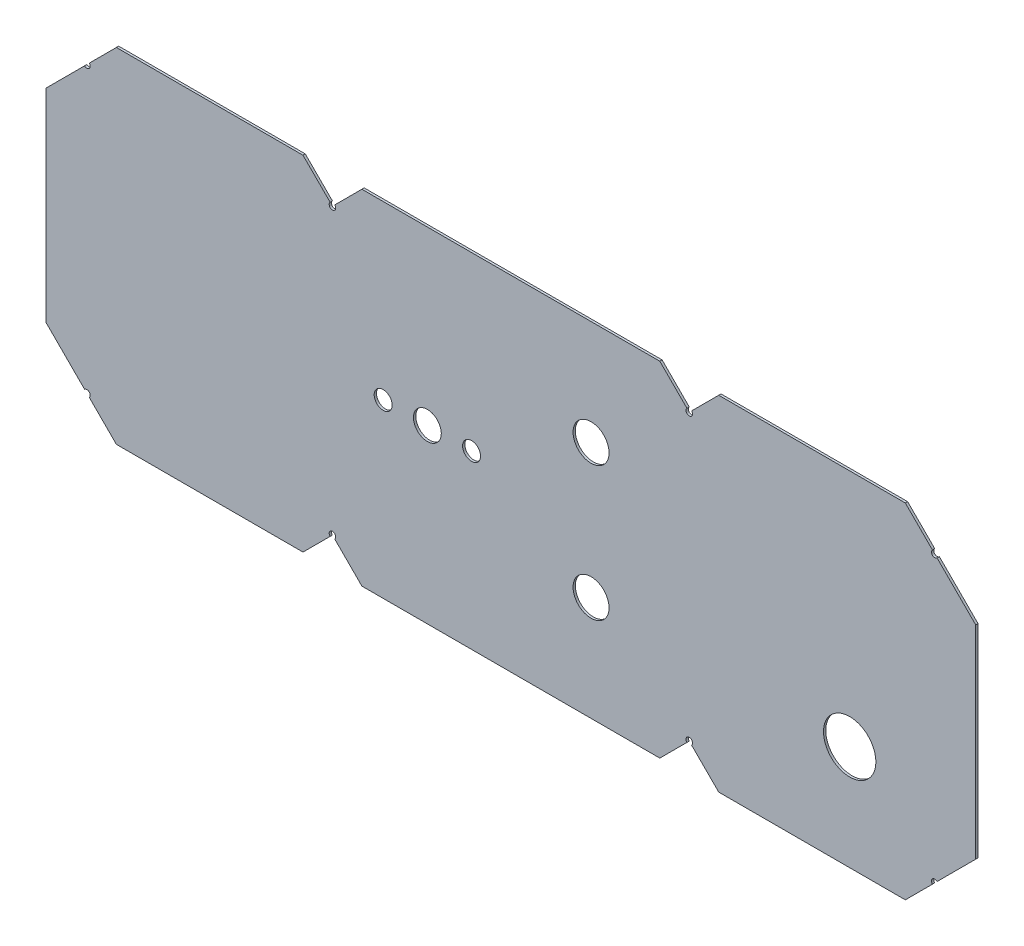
ISO-10303-21;
HEADER;
FILE_DESCRIPTION(('STEP AP214'),'2;1');
FILE_NAME('part.step','',(''),(''),'','','');
FILE_SCHEMA(('AUTOMOTIVE_DESIGN { 1 0 10303 214 1 1 1 1 }'));
ENDSEC;
DATA;
#1=APPLICATION_CONTEXT('core data for automotive mechanical design processes');
#2=APPLICATION_PROTOCOL_DEFINITION('international standard','automotive_design',2000,#1);
#3=PRODUCT_CONTEXT('',#1,'mechanical');
#4=PRODUCT('Part','Part','',(#3));
#5=PRODUCT_RELATED_PRODUCT_CATEGORY('part','',(#4));
#6=PRODUCT_DEFINITION_FORMATION('','',#4);
#7=PRODUCT_DEFINITION_CONTEXT('part definition',#1,'design');
#8=PRODUCT_DEFINITION('design','',#6,#7);
#9=PRODUCT_DEFINITION_SHAPE('','',#8);
#10=(LENGTH_UNIT() NAMED_UNIT(*) SI_UNIT(.MILLI.,.METRE.));
#11=(NAMED_UNIT(*) PLANE_ANGLE_UNIT() SI_UNIT($,.RADIAN.));
#12=(NAMED_UNIT(*) SI_UNIT($,.STERADIAN.) SOLID_ANGLE_UNIT());
#13=UNCERTAINTY_MEASURE_WITH_UNIT(LENGTH_MEASURE(1.E-05),#10,'distance_accuracy_value','');
#14=(GEOMETRIC_REPRESENTATION_CONTEXT(3) GLOBAL_UNCERTAINTY_ASSIGNED_CONTEXT((#13)) GLOBAL_UNIT_ASSIGNED_CONTEXT((#10,
#11,#12)) REPRESENTATION_CONTEXT('',''));
#15=CARTESIAN_POINT('',(0.,0.,0.));
#16=DIRECTION('',(0.,0.,1.));
#17=DIRECTION('',(1.,0.,0.));
#18=AXIS2_PLACEMENT_3D('',#15,#16,#17);
#19=CARTESIAN_POINT('',(86.4999999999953,9.00000000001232,0.7));
#20=DIRECTION('',(0.,0.,1.));
#21=DIRECTION('',(1.,0.,0.));
#22=AXIS2_PLACEMENT_3D('',#19,#20,#21);
#23=PLANE('',#22);
#24=CARTESIAN_POINT('',(129.,52.4999999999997,0.7));
#25=DIRECTION('',(0.,0.,1.));
#26=DIRECTION('',(1.,0.,0.));
#27=AXIS2_PLACEMENT_3D('',#24,#25,#26);
#28=CIRCLE('',#27,2.75000000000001);
#29=CARTESIAN_POINT('',(131.75,52.4999999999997,0.7));
#30=VERTEX_POINT('',#29);
#31=EDGE_CURVE('E543',#30,#30,#28,.T.);
#32=ORIENTED_EDGE('',*,*,#31,.F.);
#33=EDGE_LOOP('',(#32));
#34=FACE_BOUND('',#33,.T.);
#35=CARTESIAN_POINT('',(165.5,31.9999999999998,0.7));
#36=DIRECTION('',(0.,0.,1.));
#37=DIRECTION('',(1.,0.,0.));
#38=AXIS2_PLACEMENT_3D('',#35,#36,#37);
#39=CIRCLE('',#38,5.49999999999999);
#40=CARTESIAN_POINT('',(171.,31.9999999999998,0.7));
#41=VERTEX_POINT('',#40);
#42=EDGE_CURVE('E531',#41,#41,#39,.T.);
#43=ORIENTED_EDGE('',*,*,#42,.F.);
#44=EDGE_LOOP('',(#43));
#45=FACE_BOUND('',#44,.T.);
#46=CARTESIAN_POINT('',(244.5,32.,0.7));
#47=DIRECTION('',(0.,0.,1.));
#48=DIRECTION('',(1.,0.,0.));
#49=AXIS2_PLACEMENT_3D('',#46,#47,#48);
#50=CIRCLE('',#49,7.99999999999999);
#51=CARTESIAN_POINT('',(252.5,32.,0.7));
#52=VERTEX_POINT('',#51);
#53=EDGE_CURVE('E277',#52,#52,#50,.T.);
#54=ORIENTED_EDGE('',*,*,#53,.F.);
#55=EDGE_LOOP('',(#54));
#56=FACE_BOUND('',#55,.T.);
#57=DIRECTION('',(1.,0.,0.));
#58=VECTOR('',#57,1.);
#59=CARTESIAN_POINT('',(186.499999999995,1.31370660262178E-11,0.7));
#60=LINE('',#59,#58);
#61=CARTESIAN_POINT('',(95.4999999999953,1.31259217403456E-11,0.7));
#62=VERTEX_POINT('',#61);
#63=CARTESIAN_POINT('',(186.499999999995,1.31370660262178E-11,0.7));
#64=VERTEX_POINT('',#63);
#65=EDGE_CURVE('E351',#62,#64,#60,.T.);
#66=ORIENTED_EDGE('',*,*,#65,.T.);
#67=DIRECTION('',(0.707106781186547,0.707106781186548,0.));
#68=VECTOR('',#67,1.);
#69=CARTESIAN_POINT('',(194.439339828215,7.93933982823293,0.7));
#70=LINE('',#69,#68);
#71=CARTESIAN_POINT('',(194.792893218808,8.29289321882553,0.7));
#72=VERTEX_POINT('',#71);
#73=EDGE_CURVE('E162',#64,#72,#70,.T.);
#74=ORIENTED_EDGE('',*,*,#73,.T.);
#75=CARTESIAN_POINT('',(195.499999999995,9.00000000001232,0.7));
#76=DIRECTION('',(0.,0.,-1.));
#77=DIRECTION('',(1.,0.,0.));
#78=AXIS2_PLACEMENT_3D('',#75,#76,#77);
#79=CIRCLE('',#78,1.00000000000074);
#80=CARTESIAN_POINT('',(196.207106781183,8.29289321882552,0.7));
#81=VERTEX_POINT('',#80);
#82=EDGE_CURVE('E439',#72,#81,#79,.T.);
#83=ORIENTED_EDGE('',*,*,#82,.T.);
#84=DIRECTION('',(0.707106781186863,-0.707106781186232,0.));
#85=VECTOR('',#84,1.);
#86=CARTESIAN_POINT('',(196.560660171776,7.93933982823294,0.7));
#87=LINE('',#86,#85);
#88=CARTESIAN_POINT('',(204.499999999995,1.31392703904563E-11,0.7));
#89=VERTEX_POINT('',#88);
#90=EDGE_CURVE('E454',#81,#89,#87,.T.);
#91=ORIENTED_EDGE('',*,*,#90,.T.);
#92=DIRECTION('',(1.,0.,0.));
#93=VECTOR('',#92,1.);
#94=CARTESIAN_POINT('',(261.499999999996,1.31462508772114E-11,0.7));
#95=LINE('',#94,#93);
#96=CARTESIAN_POINT('',(261.499999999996,1.31462508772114E-11,0.7));
#97=VERTEX_POINT('',#96);
#98=EDGE_CURVE('E451',#89,#97,#95,.T.);
#99=ORIENTED_EDGE('',*,*,#98,.T.);
#100=DIRECTION('',(0.707106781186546,0.707106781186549,0.));
#101=VECTOR('',#100,1.);
#102=CARTESIAN_POINT('',(269.439339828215,7.93933982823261,0.7));
#103=LINE('',#102,#101);
#104=CARTESIAN_POINT('',(269.792893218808,8.29289321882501,0.7));
#105=VERTEX_POINT('',#104);
#106=EDGE_CURVE('E453',#97,#105,#103,.T.);
#107=ORIENTED_EDGE('',*,*,#106,.T.);
#108=CARTESIAN_POINT('',(270.499999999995,9.00000000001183,0.7));
#109=DIRECTION('',(0.,0.,-1.));
#110=DIRECTION('',(1.,0.,0.));
#111=AXIS2_PLACEMENT_3D('',#108,#109,#110);
#112=CIRCLE('',#111,1.00000000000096);
#113=CARTESIAN_POINT('',(271.207106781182,9.70710678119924,0.7));
#114=VERTEX_POINT('',#113);
#115=EDGE_CURVE('E456',#105,#114,#112,.T.);
#116=ORIENTED_EDGE('',*,*,#115,.T.);
#117=DIRECTION('',(0.707106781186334,0.707106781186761,0.));
#118=VECTOR('',#117,1.);
#119=CARTESIAN_POINT('',(271.560660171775,10.060660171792,0.7));
#120=LINE('',#119,#118);
#121=CARTESIAN_POINT('',(282.999999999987,21.5000000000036,0.7));
#122=VERTEX_POINT('',#121);
#123=EDGE_CURVE('E462',#114,#122,#120,.T.);
#124=ORIENTED_EDGE('',*,*,#123,.T.);
#125=DIRECTION('',(0.,1.,0.));
#126=VECTOR('',#125,1.);
#127=CARTESIAN_POINT('',(282.999999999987,83.5000000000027,0.7));
#128=LINE('',#127,#126);
#129=CARTESIAN_POINT('',(282.999999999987,83.5000000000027,0.7));
#130=VERTEX_POINT('',#129);
#131=EDGE_CURVE('E464',#122,#130,#128,.T.);
#132=ORIENTED_EDGE('',*,*,#131,.T.);
#133=DIRECTION('',(-0.707106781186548,0.707106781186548,0.));
#134=VECTOR('',#133,1.);
#135=CARTESIAN_POINT('',(281.99999999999,84.4999999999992,0.7));
#136=LINE('',#135,#134);
#137=CARTESIAN_POINT('',(271.207106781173,95.2928932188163,0.7));
#138=VERTEX_POINT('',#137);
#139=EDGE_CURVE('E466',#130,#138,#136,.T.);
#140=ORIENTED_EDGE('',*,*,#139,.T.);
#141=CARTESIAN_POINT('',(270.499999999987,96.0000000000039,0.7));
#142=DIRECTION('',(0.,0.,-1.));
#143=DIRECTION('',(1.,0.,0.));
#144=AXIS2_PLACEMENT_3D('',#141,#142,#143);
#145=CIRCLE('',#144,1.00000000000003);
#146=CARTESIAN_POINT('',(269.7928932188,96.7071067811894,0.7));
#147=VERTEX_POINT('',#146);
#148=EDGE_CURVE('E468',#138,#147,#145,.T.);
#149=ORIENTED_EDGE('',*,*,#148,.T.);
#150=DIRECTION('',(-0.707106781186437,0.707106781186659,0.));
#151=VECTOR('',#150,1.);
#152=CARTESIAN_POINT('',(269.439339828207,97.0606601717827,0.7));
#153=LINE('',#152,#151);
#154=CARTESIAN_POINT('',(261.499999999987,105.000000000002,0.7));
#155=VERTEX_POINT('',#154);
#156=EDGE_CURVE('E470',#147,#155,#153,.T.);
#157=ORIENTED_EDGE('',*,*,#156,.T.);
#158=DIRECTION('',(-1.,0.,0.));
#159=VECTOR('',#158,1.);
#160=CARTESIAN_POINT('',(204.499999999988,105.000000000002,0.7));
#161=LINE('',#160,#159);
#162=CARTESIAN_POINT('',(204.499999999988,105.000000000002,0.7));
#163=VERTEX_POINT('',#162);
#164=EDGE_CURVE('E472',#155,#163,#161,.T.);
#165=ORIENTED_EDGE('',*,*,#164,.T.);
#166=DIRECTION('',(-0.707106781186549,-0.707106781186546,0.));
#167=VECTOR('',#166,1.);
#168=CARTESIAN_POINT('',(196.560660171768,97.0606601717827,0.7));
#169=LINE('',#168,#167);
#170=CARTESIAN_POINT('',(196.207106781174,96.7071067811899,0.7));
#171=VERTEX_POINT('',#170);
#172=EDGE_CURVE('E474',#163,#171,#169,.T.);
#173=ORIENTED_EDGE('',*,*,#172,.T.);
#174=CARTESIAN_POINT('',(195.499999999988,96.0000000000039,0.7));
#175=DIRECTION('',(0.,0.,-1.));
#176=DIRECTION('',(1.,0.,0.));
#177=AXIS2_PLACEMENT_3D('',#174,#175,#176);
#178=CIRCLE('',#177,0.999999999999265);
#179=CARTESIAN_POINT('',(194.7928932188,96.7071067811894,0.7));
#180=VERTEX_POINT('',#179);
#181=EDGE_CURVE('E476',#171,#180,#178,.T.);
#182=ORIENTED_EDGE('',*,*,#181,.T.);
#183=DIRECTION('',(-0.70710678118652,0.707106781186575,0.));
#184=VECTOR('',#183,1.);
#185=CARTESIAN_POINT('',(194.439339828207,97.0606601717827,0.7));
#186=LINE('',#185,#184);
#187=CARTESIAN_POINT('',(186.499999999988,105.000000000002,0.7));
#188=VERTEX_POINT('',#187);
#189=EDGE_CURVE('E478',#180,#188,#186,.T.);
#190=ORIENTED_EDGE('',*,*,#189,.T.);
#191=DIRECTION('',(-1.,0.,0.));
#192=VECTOR('',#191,1.);
#193=CARTESIAN_POINT('',(149.999999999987,105.000000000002,0.7));
#194=LINE('',#193,#192);
#195=CARTESIAN_POINT('',(95.4999999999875,105.000000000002,0.7));
#196=VERTEX_POINT('',#195);
#197=EDGE_CURVE('E480',#188,#196,#194,.T.);
#198=ORIENTED_EDGE('',*,*,#197,.T.);
#199=DIRECTION('',(-0.707106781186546,-0.707106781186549,0.));
#200=VECTOR('',#199,1.);
#201=CARTESIAN_POINT('',(87.5606601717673,97.0606601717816,0.7));
#202=LINE('',#201,#200);
#203=CARTESIAN_POINT('',(87.2071067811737,96.7071067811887,0.7));
#204=VERTEX_POINT('',#203);
#205=EDGE_CURVE('E482',#196,#204,#202,.T.);
#206=ORIENTED_EDGE('',*,*,#205,.T.);
#207=CARTESIAN_POINT('',(86.4999999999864,96.0000000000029,0.7));
#208=DIRECTION('',(0.,0.,-1.));
#209=DIRECTION('',(1.,0.,0.));
#210=AXIS2_PLACEMENT_3D('',#207,#208,#209);
#211=CIRCLE('',#210,0.999999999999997);
#212=CARTESIAN_POINT('',(85.7928932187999,96.7071067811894,0.7));
#213=VERTEX_POINT('',#212);
#214=EDGE_CURVE('E484',#204,#213,#211,.T.);
#215=ORIENTED_EDGE('',*,*,#214,.T.);
#216=DIRECTION('',(-0.707106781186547,0.707106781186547,0.));
#217=VECTOR('',#216,1.);
#218=CARTESIAN_POINT('',(85.4393398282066,97.0606601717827,0.7));
#219=LINE('',#218,#217);
#220=CARTESIAN_POINT('',(77.4999999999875,105.000000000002,0.7));
#221=VERTEX_POINT('',#220);
#222=EDGE_CURVE('E486',#213,#221,#219,.T.);
#223=ORIENTED_EDGE('',*,*,#222,.T.);
#224=DIRECTION('',(-1.,0.,0.));
#225=VECTOR('',#224,1.);
#226=CARTESIAN_POINT('',(20.499999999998,105.000000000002,0.7));
#227=LINE('',#226,#225);
#228=CARTESIAN_POINT('',(20.499999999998,105.000000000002,0.7));
#229=VERTEX_POINT('',#228);
#230=EDGE_CURVE('E488',#221,#229,#227,.T.);
#231=ORIENTED_EDGE('',*,*,#230,.T.);
#232=DIRECTION('',(-0.707106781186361,-0.707106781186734,0.));
#233=VECTOR('',#232,1.);
#234=CARTESIAN_POINT('',(12.56066017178,97.0606601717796,0.7));
#235=LINE('',#234,#233);
#236=CARTESIAN_POINT('',(12.2071067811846,96.7071067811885,0.7));
#237=VERTEX_POINT('',#236);
#238=EDGE_CURVE('E490',#229,#237,#235,.T.);
#239=ORIENTED_EDGE('',*,*,#238,.T.);
#240=CARTESIAN_POINT('',(11.499999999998,96.0000000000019,0.7));
#241=DIRECTION('',(0.,0.,-1.));
#242=DIRECTION('',(1.,0.,0.));
#243=AXIS2_PLACEMENT_3D('',#240,#241,#242);
#244=CIRCLE('',#243,0.999999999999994);
#245=CARTESIAN_POINT('',(10.7928932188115,95.2928932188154,0.7));
#246=VERTEX_POINT('',#245);
#247=EDGE_CURVE('E492',#237,#246,#244,.T.);
#248=ORIENTED_EDGE('',*,*,#247,.T.);
#249=DIRECTION('',(-0.707106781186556,-0.707106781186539,0.));
#250=VECTOR('',#249,1.);
#251=CARTESIAN_POINT('',(10.4393398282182,94.9393398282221,0.7));
#252=LINE('',#251,#250);
#253=CARTESIAN_POINT('',(-1.00000000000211,83.5000000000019,0.7));
#254=VERTEX_POINT('',#253);
#255=EDGE_CURVE('E494',#246,#254,#252,.T.);
#256=ORIENTED_EDGE('',*,*,#255,.T.);
#257=DIRECTION('',(0.,-1.,0.));
#258=VECTOR('',#257,1.);
#259=CARTESIAN_POINT('',(-1.00000000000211,83.5000000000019,0.7));
#260=LINE('',#259,#258);
#261=CARTESIAN_POINT('',(-1.0000000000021,21.5000000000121,0.7));
#262=VERTEX_POINT('',#261);
#263=EDGE_CURVE('E496',#254,#262,#260,.T.);
#264=ORIENTED_EDGE('',*,*,#263,.T.);
#265=DIRECTION('',(0.707106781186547,-0.707106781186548,0.));
#266=VECTOR('',#265,1.);
#267=CARTESIAN_POINT('',(-3.12560249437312E-12,20.5000000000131,0.7));
#268=LINE('',#267,#266);
#269=CARTESIAN_POINT('',(10.7928932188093,9.70710678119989,0.7));
#270=VERTEX_POINT('',#269);
#271=EDGE_CURVE('E498',#262,#270,#268,.T.);
#272=ORIENTED_EDGE('',*,*,#271,.T.);
#273=CARTESIAN_POINT('',(11.4999999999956,9.00000000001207,0.7));
#274=DIRECTION('',(0.,0.,-1.));
#275=DIRECTION('',(1.,0.,0.));
#276=AXIS2_PLACEMENT_3D('',#273,#274,#275);
#277=CIRCLE('',#276,1.00000000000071);
#278=CARTESIAN_POINT('',(12.2071067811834,8.2928932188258,0.7));
#279=VERTEX_POINT('',#278);
#280=EDGE_CURVE('E500',#270,#279,#277,.T.);
#281=ORIENTED_EDGE('',*,*,#280,.T.);
#282=DIRECTION('',(0.707106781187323,-0.707106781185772,0.));
#283=VECTOR('',#282,1.);
#284=CARTESIAN_POINT('',(12.5606601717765,7.93933982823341,0.7));
#285=LINE('',#284,#283);
#286=CARTESIAN_POINT('',(20.4999999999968,1.3116736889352E-11,0.7));
#287=VERTEX_POINT('',#286);
#288=EDGE_CURVE('E502',#279,#287,#285,.T.);
#289=ORIENTED_EDGE('',*,*,#288,.T.);
#290=DIRECTION('',(1.,0.,0.));
#291=VECTOR('',#290,1.);
#292=CARTESIAN_POINT('',(77.4999999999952,1.31237173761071E-11,0.7));
#293=LINE('',#292,#291);
#294=CARTESIAN_POINT('',(77.4999999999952,1.31237173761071E-11,0.7));
#295=VERTEX_POINT('',#294);
#296=EDGE_CURVE('E254',#287,#295,#293,.T.);
#297=ORIENTED_EDGE('',*,*,#296,.T.);
#298=DIRECTION('',(0.707106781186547,0.707106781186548,0.));
#299=VECTOR('',#298,1.);
#300=CARTESIAN_POINT('',(85.439339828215,7.93933982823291,0.7));
#301=LINE('',#300,#299);
#302=CARTESIAN_POINT('',(85.7928932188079,8.2928932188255,0.7));
#303=VERTEX_POINT('',#302);
#304=EDGE_CURVE('E247',#295,#303,#301,.T.);
#305=ORIENTED_EDGE('',*,*,#304,.T.);
#306=CARTESIAN_POINT('',(86.4999999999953,9.00000000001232,0.7));
#307=DIRECTION('',(0.,0.,-1.));
#308=DIRECTION('',(1.,0.,0.));
#309=AXIS2_PLACEMENT_3D('',#306,#307,#308);
#310=CIRCLE('',#309,1.00000000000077);
#311=CARTESIAN_POINT('',(87.2071067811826,8.29289321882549,0.7));
#312=VERTEX_POINT('',#311);
#313=EDGE_CURVE('E251',#303,#312,#310,.T.);
#314=ORIENTED_EDGE('',*,*,#313,.T.);
#315=DIRECTION('',(0.707106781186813,-0.707106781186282,0.));
#316=VECTOR('',#315,1.);
#317=CARTESIAN_POINT('',(87.5606601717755,7.9393398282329,0.7));
#318=LINE('',#317,#316);
#319=EDGE_CURVE('E50',#312,#62,#318,.T.);
#320=ORIENTED_EDGE('',*,*,#319,.T.);
#321=EDGE_LOOP('',(#66,#74,#83,#91,#99,#107,#116,#124,#132,#140,#149,#157,#165,#173,#182,#190,
#198,#206,#215,#223,#231,#239,#248,#256,#264,#272,#281,#289,#297,#305,#314,#320));
#322=FACE_BOUND('',#321,.T.);
#323=CARTESIAN_POINT('',(165.5,72.9999999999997,0.7));
#324=DIRECTION('',(0.,0.,1.));
#325=DIRECTION('',(1.,0.,0.));
#326=AXIS2_PLACEMENT_3D('',#323,#324,#325);
#327=CIRCLE('',#326,5.50000000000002);
#328=CARTESIAN_POINT('',(171.,72.9999999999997,0.7));
#329=VERTEX_POINT('',#328);
#330=EDGE_CURVE('E525',#329,#329,#327,.T.);
#331=ORIENTED_EDGE('',*,*,#330,.F.);
#332=EDGE_LOOP('',(#331));
#333=FACE_BOUND('',#332,.T.);
#334=CARTESIAN_POINT('',(102.,52.4999999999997,0.7));
#335=DIRECTION('',(0.,0.,1.));
#336=DIRECTION('',(1.,0.,0.));
#337=AXIS2_PLACEMENT_3D('',#334,#335,#336);
#338=CIRCLE('',#337,2.75000000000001);
#339=CARTESIAN_POINT('',(104.75,52.4999999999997,0.7));
#340=VERTEX_POINT('',#339);
#341=EDGE_CURVE('E537',#340,#340,#338,.T.);
#342=ORIENTED_EDGE('',*,*,#341,.F.);
#343=EDGE_LOOP('',(#342));
#344=FACE_BOUND('',#343,.T.);
#345=CARTESIAN_POINT('',(115.5,52.4999999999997,0.7));
#346=DIRECTION('',(0.,0.,1.));
#347=DIRECTION('',(1.,0.,0.));
#348=AXIS2_PLACEMENT_3D('',#345,#346,#347);
#349=CIRCLE('',#348,4.25);
#350=CARTESIAN_POINT('',(119.75,52.4999999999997,0.7));
#351=VERTEX_POINT('',#350);
#352=EDGE_CURVE('E549',#351,#351,#349,.T.);
#353=ORIENTED_EDGE('',*,*,#352,.F.);
#354=EDGE_LOOP('',(#353));
#355=FACE_BOUND('',#354,.T.);
#356=ADVANCED_FACE('F33',(#34,#45,#56,#322,#333,#344,#355),#23,.T.);
#357=CARTESIAN_POINT('',(86.4999999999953,9.00000000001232,0.));
#358=DIRECTION('',(0.,0.,1.));
#359=DIRECTION('',(1.,0.,0.));
#360=AXIS2_PLACEMENT_3D('',#357,#358,#359);
#361=PLANE('',#360);
#362=CARTESIAN_POINT('',(129.,52.4999999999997,0.));
#363=DIRECTION('',(0.,0.,1.));
#364=DIRECTION('',(1.,0.,0.));
#365=AXIS2_PLACEMENT_3D('',#362,#363,#364);
#366=CIRCLE('',#365,2.75000000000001);
#367=CARTESIAN_POINT('',(131.75,52.4999999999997,0.));
#368=VERTEX_POINT('',#367);
#369=EDGE_CURVE('E546',#368,#368,#366,.T.);
#370=ORIENTED_EDGE('',*,*,#369,.T.);
#371=EDGE_LOOP('',(#370));
#372=FACE_BOUND('',#371,.T.);
#373=CARTESIAN_POINT('',(165.5,31.9999999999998,0.));
#374=DIRECTION('',(0.,0.,1.));
#375=DIRECTION('',(1.,0.,0.));
#376=AXIS2_PLACEMENT_3D('',#373,#374,#375);
#377=CIRCLE('',#376,5.49999999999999);
#378=CARTESIAN_POINT('',(171.,31.9999999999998,0.));
#379=VERTEX_POINT('',#378);
#380=EDGE_CURVE('E534',#379,#379,#377,.T.);
#381=ORIENTED_EDGE('',*,*,#380,.T.);
#382=EDGE_LOOP('',(#381));
#383=FACE_BOUND('',#382,.T.);
#384=CARTESIAN_POINT('',(244.5,32.,0.));
#385=DIRECTION('',(0.,0.,1.));
#386=DIRECTION('',(1.,0.,0.));
#387=AXIS2_PLACEMENT_3D('',#384,#385,#386);
#388=CIRCLE('',#387,7.99999999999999);
#389=CARTESIAN_POINT('',(252.5,32.,0.));
#390=VERTEX_POINT('',#389);
#391=EDGE_CURVE('E522',#390,#390,#388,.T.);
#392=ORIENTED_EDGE('',*,*,#391,.T.);
#393=EDGE_LOOP('',(#392));
#394=FACE_BOUND('',#393,.T.);
#395=DIRECTION('',(0.707106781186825,0.70710678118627,0.));
#396=VECTOR('',#395,1.);
#397=CARTESIAN_POINT('',(194.439339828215,7.93933982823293,0.));
#398=LINE('',#397,#396);
#399=CARTESIAN_POINT('',(186.499999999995,1.31370660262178E-11,0.));
#400=VERTEX_POINT('',#399);
#401=CARTESIAN_POINT('',(194.792893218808,8.29289321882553,0.));
#402=VERTEX_POINT('',#401);
#403=EDGE_CURVE('E274',#400,#402,#398,.T.);
#404=ORIENTED_EDGE('',*,*,#403,.F.);
#405=DIRECTION('',(1.,0.,0.));
#406=VECTOR('',#405,1.);
#407=CARTESIAN_POINT('',(131.999999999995,1.31303917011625E-11,0.));
#408=LINE('',#407,#406);
#409=CARTESIAN_POINT('',(95.4999999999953,1.31259217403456E-11,0.));
#410=VERTEX_POINT('',#409);
#411=EDGE_CURVE('E155',#410,#400,#408,.T.);
#412=ORIENTED_EDGE('',*,*,#411,.F.);
#413=DIRECTION('',(0.707106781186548,-0.707106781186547,0.));
#414=VECTOR('',#413,1.);
#415=CARTESIAN_POINT('',(87.5606601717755,7.9393398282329,0.));
#416=LINE('',#415,#414);
#417=CARTESIAN_POINT('',(87.2071067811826,8.29289321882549,0.));
#418=VERTEX_POINT('',#417);
#419=EDGE_CURVE('E151',#418,#410,#416,.T.);
#420=ORIENTED_EDGE('',*,*,#419,.F.);
#421=CARTESIAN_POINT('',(86.4999999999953,9.00000000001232,0.));
#422=DIRECTION('',(0.,0.,-1.));
#423=DIRECTION('',(1.,0.,0.));
#424=AXIS2_PLACEMENT_3D('',#421,#422,#423);
#425=CIRCLE('',#424,1.00000000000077);
#426=CARTESIAN_POINT('',(85.7928932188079,8.2928932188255,0.));
#427=VERTEX_POINT('',#426);
#428=EDGE_CURVE('E347',#427,#418,#425,.T.);
#429=ORIENTED_EDGE('',*,*,#428,.F.);
#430=DIRECTION('',(0.70710678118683,0.707106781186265,0.));
#431=VECTOR('',#430,1.);
#432=CARTESIAN_POINT('',(85.439339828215,7.93933982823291,0.));
#433=LINE('',#432,#431);
#434=CARTESIAN_POINT('',(77.4999999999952,1.31237173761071E-11,0.));
#435=VERTEX_POINT('',#434);
#436=EDGE_CURVE('E262',#435,#427,#433,.T.);
#437=ORIENTED_EDGE('',*,*,#436,.F.);
#438=DIRECTION('',(1.,0.,0.));
#439=VECTOR('',#438,1.);
#440=CARTESIAN_POINT('',(77.4999999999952,1.31237173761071E-11,0.));
#441=LINE('',#440,#439);
#442=CARTESIAN_POINT('',(20.4999999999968,1.3116736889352E-11,0.));
#443=VERTEX_POINT('',#442);
#444=EDGE_CURVE('E343',#443,#435,#441,.T.);
#445=ORIENTED_EDGE('',*,*,#444,.F.);
#446=DIRECTION('',(0.707106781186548,-0.707106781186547,0.));
#447=VECTOR('',#446,1.);
#448=CARTESIAN_POINT('',(12.5606601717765,7.93933982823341,0.));
#449=LINE('',#448,#447);
#450=CARTESIAN_POINT('',(12.2071067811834,8.2928932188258,0.));
#451=VERTEX_POINT('',#450);
#452=EDGE_CURVE('E341',#451,#443,#449,.T.);
#453=ORIENTED_EDGE('',*,*,#452,.F.);
#454=CARTESIAN_POINT('',(11.4999999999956,9.00000000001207,0.));
#455=DIRECTION('',(0.,0.,-1.));
#456=DIRECTION('',(1.,0.,0.));
#457=AXIS2_PLACEMENT_3D('',#454,#455,#456);
#458=CIRCLE('',#457,1.00000000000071);
#459=CARTESIAN_POINT('',(10.7928932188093,9.70710678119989,0.));
#460=VERTEX_POINT('',#459);
#461=EDGE_CURVE('E338',#460,#451,#458,.T.);
#462=ORIENTED_EDGE('',*,*,#461,.F.);
#463=DIRECTION('',(0.707106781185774,-0.707106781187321,0.));
#464=VECTOR('',#463,1.);
#465=CARTESIAN_POINT('',(10.4393398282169,10.0606601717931,0.));
#466=LINE('',#465,#464);
#467=CARTESIAN_POINT('',(-1.0000000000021,21.5000000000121,0.));
#468=VERTEX_POINT('',#467);
#469=EDGE_CURVE('E336',#468,#460,#466,.T.);
#470=ORIENTED_EDGE('',*,*,#469,.F.);
#471=DIRECTION('',(0.,-1.,0.));
#472=VECTOR('',#471,1.);
#473=CARTESIAN_POINT('',(-1.00000000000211,83.5000000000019,0.));
#474=LINE('',#473,#472);
#475=CARTESIAN_POINT('',(-1.00000000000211,83.5000000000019,0.));
#476=VERTEX_POINT('',#475);
#477=EDGE_CURVE('E333',#476,#468,#474,.T.);
#478=ORIENTED_EDGE('',*,*,#477,.F.);
#479=DIRECTION('',(-0.707106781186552,-0.707106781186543,0.));
#480=VECTOR('',#479,1.);
#481=CARTESIAN_POINT('',(-5.69004313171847E-12,84.4999999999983,0.));
#482=LINE('',#481,#480);
#483=CARTESIAN_POINT('',(10.7928932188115,95.2928932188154,0.));
#484=VERTEX_POINT('',#483);
#485=EDGE_CURVE('E331',#484,#476,#482,.T.);
#486=ORIENTED_EDGE('',*,*,#485,.F.);
#487=CARTESIAN_POINT('',(11.499999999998,96.0000000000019,0.));
#488=DIRECTION('',(0.,0.,-1.));
#489=DIRECTION('',(1.,0.,0.));
#490=AXIS2_PLACEMENT_3D('',#487,#488,#489);
#491=CIRCLE('',#490,0.999999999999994);
#492=CARTESIAN_POINT('',(12.2071067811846,96.7071067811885,0.));
#493=VERTEX_POINT('',#492);
#494=EDGE_CURVE('E328',#493,#484,#491,.T.);
#495=ORIENTED_EDGE('',*,*,#494,.F.);
#496=DIRECTION('',(-0.707106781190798,-0.707106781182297,0.));
#497=VECTOR('',#496,1.);
#498=CARTESIAN_POINT('',(12.56066017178,97.0606601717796,0.));
#499=LINE('',#498,#497);
#500=CARTESIAN_POINT('',(20.499999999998,105.000000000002,0.));
#501=VERTEX_POINT('',#500);
#502=EDGE_CURVE('E326',#501,#493,#499,.T.);
#503=ORIENTED_EDGE('',*,*,#502,.F.);
#504=DIRECTION('',(-1.,0.,0.));
#505=VECTOR('',#504,1.);
#506=CARTESIAN_POINT('',(20.499999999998,105.000000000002,0.));
#507=LINE('',#506,#505);
#508=CARTESIAN_POINT('',(77.4999999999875,105.000000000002,0.));
#509=VERTEX_POINT('',#508);
#510=EDGE_CURVE('E323',#509,#501,#507,.T.);
#511=ORIENTED_EDGE('',*,*,#510,.F.);
#512=DIRECTION('',(-0.707106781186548,0.707106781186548,0.));
#513=VECTOR('',#512,1.);
#514=CARTESIAN_POINT('',(85.4393398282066,97.0606601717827,0.));
#515=LINE('',#514,#513);
#516=CARTESIAN_POINT('',(85.7928932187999,96.7071067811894,0.));
#517=VERTEX_POINT('',#516);
#518=EDGE_CURVE('E321',#517,#509,#515,.T.);
#519=ORIENTED_EDGE('',*,*,#518,.F.);
#520=CARTESIAN_POINT('',(86.4999999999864,96.0000000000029,0.));
#521=DIRECTION('',(0.,0.,-1.));
#522=DIRECTION('',(1.,0.,0.));
#523=AXIS2_PLACEMENT_3D('',#520,#521,#522);
#524=CIRCLE('',#523,0.999999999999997);
#525=CARTESIAN_POINT('',(87.2071067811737,96.7071067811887,0.));
#526=VERTEX_POINT('',#525);
#527=EDGE_CURVE('E318',#526,#517,#524,.T.);
#528=ORIENTED_EDGE('',*,*,#527,.F.);
#529=DIRECTION('',(-0.707106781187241,-0.707106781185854,0.));
#530=VECTOR('',#529,1.);
#531=CARTESIAN_POINT('',(87.5606601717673,97.0606601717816,0.));
#532=LINE('',#531,#530);
#533=CARTESIAN_POINT('',(95.4999999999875,105.000000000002,0.));
#534=VERTEX_POINT('',#533);
#535=EDGE_CURVE('E316',#534,#526,#532,.T.);
#536=ORIENTED_EDGE('',*,*,#535,.F.);
#537=DIRECTION('',(-1.,0.,0.));
#538=VECTOR('',#537,1.);
#539=CARTESIAN_POINT('',(95.4999999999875,105.000000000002,0.));
#540=LINE('',#539,#538);
#541=CARTESIAN_POINT('',(186.499999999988,105.000000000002,0.));
#542=VERTEX_POINT('',#541);
#543=EDGE_CURVE('E313',#542,#534,#540,.T.);
#544=ORIENTED_EDGE('',*,*,#543,.F.);
#545=DIRECTION('',(-0.707106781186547,0.707106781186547,0.));
#546=VECTOR('',#545,1.);
#547=CARTESIAN_POINT('',(194.439339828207,97.0606601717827,0.));
#548=LINE('',#547,#546);
#549=CARTESIAN_POINT('',(194.7928932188,96.7071067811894,0.));
#550=VERTEX_POINT('',#549);
#551=EDGE_CURVE('E310',#550,#542,#548,.T.);
#552=ORIENTED_EDGE('',*,*,#551,.F.);
#553=CARTESIAN_POINT('',(195.499999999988,96.0000000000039,0.));
#554=DIRECTION('',(0.,0.,-1.));
#555=DIRECTION('',(1.,0.,0.));
#556=AXIS2_PLACEMENT_3D('',#553,#554,#555);
#557=CIRCLE('',#556,0.999999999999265);
#558=CARTESIAN_POINT('',(196.207106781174,96.7071067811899,0.));
#559=VERTEX_POINT('',#558);
#560=EDGE_CURVE('E307',#559,#550,#557,.T.);
#561=ORIENTED_EDGE('',*,*,#560,.F.);
#562=DIRECTION('',(-0.707106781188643,-0.707106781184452,0.));
#563=VECTOR('',#562,1.);
#564=CARTESIAN_POINT('',(196.560660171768,97.0606601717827,0.));
#565=LINE('',#564,#563);
#566=CARTESIAN_POINT('',(204.499999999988,105.000000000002,0.));
#567=VERTEX_POINT('',#566);
#568=EDGE_CURVE('E305',#567,#559,#565,.T.);
#569=ORIENTED_EDGE('',*,*,#568,.F.);
#570=DIRECTION('',(-1.,0.,0.));
#571=VECTOR('',#570,1.);
#572=CARTESIAN_POINT('',(204.499999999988,105.000000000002,0.));
#573=LINE('',#572,#571);
#574=CARTESIAN_POINT('',(261.499999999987,105.000000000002,0.));
#575=VERTEX_POINT('',#574);
#576=EDGE_CURVE('E302',#575,#567,#573,.T.);
#577=ORIENTED_EDGE('',*,*,#576,.F.);
#578=DIRECTION('',(-0.707106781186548,0.707106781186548,0.));
#579=VECTOR('',#578,1.);
#580=CARTESIAN_POINT('',(269.439339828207,97.0606601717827,0.));
#581=LINE('',#580,#579);
#582=CARTESIAN_POINT('',(269.7928932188,96.7071067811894,0.));
#583=VERTEX_POINT('',#582);
#584=EDGE_CURVE('E300',#583,#575,#581,.T.);
#585=ORIENTED_EDGE('',*,*,#584,.F.);
#586=CARTESIAN_POINT('',(270.499999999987,96.0000000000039,0.));
#587=DIRECTION('',(0.,0.,-1.));
#588=DIRECTION('',(1.,0.,0.));
#589=AXIS2_PLACEMENT_3D('',#586,#587,#588);
#590=CIRCLE('',#589,1.00000000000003);
#591=CARTESIAN_POINT('',(271.207106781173,95.2928932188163,0.));
#592=VERTEX_POINT('',#591);
#593=EDGE_CURVE('E297',#592,#583,#590,.T.);
#594=ORIENTED_EDGE('',*,*,#593,.F.);
#595=DIRECTION('',(-0.707106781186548,0.707106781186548,0.));
#596=VECTOR('',#595,1.);
#597=CARTESIAN_POINT('',(271.560660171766,94.939339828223,0.));
#598=LINE('',#597,#596);
#599=CARTESIAN_POINT('',(282.999999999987,83.5000000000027,0.));
#600=VERTEX_POINT('',#599);
#601=EDGE_CURVE('E295',#600,#592,#598,.T.);
#602=ORIENTED_EDGE('',*,*,#601,.F.);
#603=DIRECTION('',(0.,1.,0.));
#604=VECTOR('',#603,1.);
#605=CARTESIAN_POINT('',(282.999999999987,83.5000000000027,0.));
#606=LINE('',#605,#604);
#607=CARTESIAN_POINT('',(282.999999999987,21.5000000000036,0.));
#608=VERTEX_POINT('',#607);
#609=EDGE_CURVE('E292',#608,#600,#606,.T.);
#610=ORIENTED_EDGE('',*,*,#609,.F.);
#611=DIRECTION('',(0.707106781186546,0.707106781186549,0.));
#612=VECTOR('',#611,1.);
#613=CARTESIAN_POINT('',(281.999999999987,20.500000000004,0.));
#614=LINE('',#613,#612);
#615=CARTESIAN_POINT('',(271.207106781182,9.70710678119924,0.));
#616=VERTEX_POINT('',#615);
#617=EDGE_CURVE('E290',#616,#608,#614,.T.);
#618=ORIENTED_EDGE('',*,*,#617,.F.);
#619=CARTESIAN_POINT('',(270.499999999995,9.00000000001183,0.));
#620=DIRECTION('',(0.,0.,-1.));
#621=DIRECTION('',(1.,0.,0.));
#622=AXIS2_PLACEMENT_3D('',#619,#620,#621);
#623=CIRCLE('',#622,1.00000000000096);
#624=CARTESIAN_POINT('',(269.792893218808,8.29289321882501,0.));
#625=VERTEX_POINT('',#624);
#626=EDGE_CURVE('E287',#625,#616,#623,.T.);
#627=ORIENTED_EDGE('',*,*,#626,.F.);
#628=DIRECTION('',(0.707106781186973,0.707106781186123,0.));
#629=VECTOR('',#628,1.);
#630=CARTESIAN_POINT('',(269.439339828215,7.93933982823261,0.));
#631=LINE('',#630,#629);
#632=CARTESIAN_POINT('',(261.499999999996,1.31462508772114E-11,0.));
#633=VERTEX_POINT('',#632);
#634=EDGE_CURVE('E285',#633,#625,#631,.T.);
#635=ORIENTED_EDGE('',*,*,#634,.F.);
#636=DIRECTION('',(1.,0.,0.));
#637=VECTOR('',#636,1.);
#638=CARTESIAN_POINT('',(261.499999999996,1.31462508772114E-11,0.));
#639=LINE('',#638,#637);
#640=CARTESIAN_POINT('',(204.499999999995,1.31392703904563E-11,0.));
#641=VERTEX_POINT('',#640);
#642=EDGE_CURVE('E282',#641,#633,#639,.T.);
#643=ORIENTED_EDGE('',*,*,#642,.F.);
#644=DIRECTION('',(0.707106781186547,-0.707106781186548,0.));
#645=VECTOR('',#644,1.);
#646=CARTESIAN_POINT('',(196.560660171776,7.93933982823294,0.));
#647=LINE('',#646,#645);
#648=CARTESIAN_POINT('',(196.207106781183,8.29289321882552,0.));
#649=VERTEX_POINT('',#648);
#650=EDGE_CURVE('E280',#649,#641,#647,.T.);
#651=ORIENTED_EDGE('',*,*,#650,.F.);
#652=CARTESIAN_POINT('',(195.499999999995,9.00000000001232,0.));
#653=DIRECTION('',(0.,0.,-1.));
#654=DIRECTION('',(1.,0.,0.));
#655=AXIS2_PLACEMENT_3D('',#652,#653,#654);
#656=CIRCLE('',#655,1.00000000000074);
#657=EDGE_CURVE('E276',#402,#649,#656,.T.);
#658=ORIENTED_EDGE('',*,*,#657,.F.);
#659=EDGE_LOOP('',(#404,#412,#420,#429,#437,#445,#453,#462,#470,#478,#486,#495,#503,#511,#519,
#528,#536,#544,#552,#561,#569,#577,#585,#594,#602,#610,#618,#627,#635,#643,#651,#658));
#660=FACE_BOUND('',#659,.T.);
#661=CARTESIAN_POINT('',(165.5,72.9999999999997,0.));
#662=DIRECTION('',(0.,0.,1.));
#663=DIRECTION('',(1.,0.,0.));
#664=AXIS2_PLACEMENT_3D('',#661,#662,#663);
#665=CIRCLE('',#664,5.50000000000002);
#666=CARTESIAN_POINT('',(171.,72.9999999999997,0.));
#667=VERTEX_POINT('',#666);
#668=EDGE_CURVE('E528',#667,#667,#665,.T.);
#669=ORIENTED_EDGE('',*,*,#668,.T.);
#670=EDGE_LOOP('',(#669));
#671=FACE_BOUND('',#670,.T.);
#672=CARTESIAN_POINT('',(102.,52.4999999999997,0.));
#673=DIRECTION('',(0.,0.,1.));
#674=DIRECTION('',(1.,0.,0.));
#675=AXIS2_PLACEMENT_3D('',#672,#673,#674);
#676=CIRCLE('',#675,2.75000000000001);
#677=CARTESIAN_POINT('',(104.75,52.4999999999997,0.));
#678=VERTEX_POINT('',#677);
#679=EDGE_CURVE('E540',#678,#678,#676,.T.);
#680=ORIENTED_EDGE('',*,*,#679,.T.);
#681=EDGE_LOOP('',(#680));
#682=FACE_BOUND('',#681,.T.);
#683=CARTESIAN_POINT('',(115.5,52.4999999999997,0.));
#684=DIRECTION('',(0.,0.,1.));
#685=DIRECTION('',(1.,0.,0.));
#686=AXIS2_PLACEMENT_3D('',#683,#684,#685);
#687=CIRCLE('',#686,4.25);
#688=CARTESIAN_POINT('',(119.75,52.4999999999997,0.));
#689=VERTEX_POINT('',#688);
#690=EDGE_CURVE('E552',#689,#689,#687,.T.);
#691=ORIENTED_EDGE('',*,*,#690,.T.);
#692=EDGE_LOOP('',(#691));
#693=FACE_BOUND('',#692,.T.);
#694=ADVANCED_FACE('F440',(#372,#383,#394,#660,#671,#682,#693),#361,.F.);
#695=CARTESIAN_POINT('',(194.439339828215,7.93933982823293,0.7));
#696=DIRECTION('',(-0.70710678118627,0.707106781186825,0.));
#697=DIRECTION('',(-0.707106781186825,-0.70710678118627,0.));
#698=AXIS2_PLACEMENT_3D('',#695,#696,#697);
#699=PLANE('',#698);
#700=ORIENTED_EDGE('',*,*,#403,.T.);
#701=DIRECTION('',(0.,0.,-1.));
#702=VECTOR('',#701,1.);
#703=CARTESIAN_POINT('',(194.792893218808,8.29289321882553,0.7));
#704=LINE('',#703,#702);
#705=EDGE_CURVE('E42',#72,#402,#704,.T.);
#706=ORIENTED_EDGE('',*,*,#705,.F.);
#707=ORIENTED_EDGE('',*,*,#73,.F.);
#708=DIRECTION('',(0.,0.,-1.));
#709=VECTOR('',#708,1.);
#710=CARTESIAN_POINT('',(186.499999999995,1.31370660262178E-11,0.7));
#711=LINE('',#710,#709);
#712=EDGE_CURVE('E11',#64,#400,#711,.T.);
#713=ORIENTED_EDGE('',*,*,#712,.T.);
#714=EDGE_LOOP('',(#700,#706,#707,#713));
#715=FACE_BOUND('',#714,.T.);
#716=ADVANCED_FACE('F35',(#715),#699,.F.);
#717=CARTESIAN_POINT('',(195.499999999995,9.00000000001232,0.7));
#718=DIRECTION('',(0.,0.,-1.));
#719=DIRECTION('',(-1.,0.,0.));
#720=AXIS2_PLACEMENT_3D('',#717,#718,#719);
#721=CYLINDRICAL_SURFACE('',#720,1.00000000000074);
#722=ORIENTED_EDGE('',*,*,#657,.T.);
#723=DIRECTION('',(0.,0.,-1.));
#724=VECTOR('',#723,1.);
#725=CARTESIAN_POINT('',(196.207106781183,8.29289321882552,0.7));
#726=LINE('',#725,#724);
#727=EDGE_CURVE('E431',#81,#649,#726,.T.);
#728=ORIENTED_EDGE('',*,*,#727,.F.);
#729=ORIENTED_EDGE('',*,*,#82,.F.);
#730=ORIENTED_EDGE('',*,*,#705,.T.);
#731=EDGE_LOOP('',(#722,#728,#729,#730));
#732=FACE_BOUND('',#731,.T.);
#733=ADVANCED_FACE('F437',(#732),#721,.F.);
#734=CARTESIAN_POINT('',(196.560660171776,7.93933982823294,0.7));
#735=DIRECTION('',(0.707106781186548,0.707106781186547,0.));
#736=DIRECTION('',(-0.707106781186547,0.707106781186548,0.));
#737=AXIS2_PLACEMENT_3D('',#734,#735,#736);
#738=PLANE('',#737);
#739=ORIENTED_EDGE('',*,*,#650,.T.);
#740=DIRECTION('',(0.,0.,-1.));
#741=VECTOR('',#740,1.);
#742=CARTESIAN_POINT('',(204.499999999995,1.31392703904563E-11,0.7));
#743=LINE('',#742,#741);
#744=EDGE_CURVE('E428',#89,#641,#743,.T.);
#745=ORIENTED_EDGE('',*,*,#744,.F.);
#746=ORIENTED_EDGE('',*,*,#90,.F.);
#747=ORIENTED_EDGE('',*,*,#727,.T.);
#748=EDGE_LOOP('',(#739,#745,#746,#747));
#749=FACE_BOUND('',#748,.T.);
#750=ADVANCED_FACE('F445',(#749),#738,.F.);
#751=CARTESIAN_POINT('',(261.499999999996,1.31462508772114E-11,0.7));
#752=DIRECTION('',(0.,1.,0.));
#753=DIRECTION('',(-1.,0.,0.));
#754=AXIS2_PLACEMENT_3D('',#751,#752,#753);
#755=PLANE('',#754);
#756=ORIENTED_EDGE('',*,*,#642,.T.);
#757=DIRECTION('',(0.,0.,-1.));
#758=VECTOR('',#757,1.);
#759=CARTESIAN_POINT('',(261.499999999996,1.31462508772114E-11,0.7));
#760=LINE('',#759,#758);
#761=EDGE_CURVE('E425',#97,#633,#760,.T.);
#762=ORIENTED_EDGE('',*,*,#761,.F.);
#763=ORIENTED_EDGE('',*,*,#98,.F.);
#764=ORIENTED_EDGE('',*,*,#744,.T.);
#765=EDGE_LOOP('',(#756,#762,#763,#764));
#766=FACE_BOUND('',#765,.T.);
#767=ADVANCED_FACE('F449',(#766),#755,.F.);
#768=CARTESIAN_POINT('',(269.439339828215,7.93933982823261,0.7));
#769=DIRECTION('',(-0.707106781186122,0.707106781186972,0.));
#770=DIRECTION('',(-0.707106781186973,-0.707106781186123,0.));
#771=AXIS2_PLACEMENT_3D('',#768,#769,#770);
#772=PLANE('',#771);
#773=ORIENTED_EDGE('',*,*,#634,.T.);
#774=DIRECTION('',(0.,0.,-1.));
#775=VECTOR('',#774,1.);
#776=CARTESIAN_POINT('',(269.792893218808,8.29289321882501,0.7));
#777=LINE('',#776,#775);
#778=EDGE_CURVE('E422',#105,#625,#777,.T.);
#779=ORIENTED_EDGE('',*,*,#778,.F.);
#780=ORIENTED_EDGE('',*,*,#106,.F.);
#781=ORIENTED_EDGE('',*,*,#761,.T.);
#782=EDGE_LOOP('',(#773,#779,#780,#781));
#783=FACE_BOUND('',#782,.T.);
#784=ADVANCED_FACE('F670',(#783),#772,.F.);
#785=CARTESIAN_POINT('',(270.499999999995,9.00000000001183,0.7));
#786=DIRECTION('',(0.,0.,-1.));
#787=DIRECTION('',(-1.,0.,0.));
#788=AXIS2_PLACEMENT_3D('',#785,#786,#787);
#789=CYLINDRICAL_SURFACE('',#788,1.00000000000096);
#790=ORIENTED_EDGE('',*,*,#626,.T.);
#791=DIRECTION('',(0.,0.,-1.));
#792=VECTOR('',#791,1.);
#793=CARTESIAN_POINT('',(271.207106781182,9.70710678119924,0.7));
#794=LINE('',#793,#792);
#795=EDGE_CURVE('E419',#114,#616,#794,.T.);
#796=ORIENTED_EDGE('',*,*,#795,.F.);
#797=ORIENTED_EDGE('',*,*,#115,.F.);
#798=ORIENTED_EDGE('',*,*,#778,.T.);
#799=EDGE_LOOP('',(#790,#796,#797,#798));
#800=FACE_BOUND('',#799,.T.);
#801=ADVANCED_FACE('F666',(#800),#789,.F.);
#802=CARTESIAN_POINT('',(281.999999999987,20.500000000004,0.7));
#803=DIRECTION('',(-0.707106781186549,0.707106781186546,0.));
#804=DIRECTION('',(-0.707106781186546,-0.707106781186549,0.));
#805=AXIS2_PLACEMENT_3D('',#802,#803,#804);
#806=PLANE('',#805);
#807=ORIENTED_EDGE('',*,*,#617,.T.);
#808=DIRECTION('',(0.,0.,-1.));
#809=VECTOR('',#808,1.);
#810=CARTESIAN_POINT('',(282.999999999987,21.5000000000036,0.7));
#811=LINE('',#810,#809);
#812=EDGE_CURVE('E416',#122,#608,#811,.T.);
#813=ORIENTED_EDGE('',*,*,#812,.F.);
#814=ORIENTED_EDGE('',*,*,#123,.F.);
#815=ORIENTED_EDGE('',*,*,#795,.T.);
#816=EDGE_LOOP('',(#807,#813,#814,#815));
#817=FACE_BOUND('',#816,.T.);
#818=ADVANCED_FACE('F662',(#817),#806,.F.);
#819=CARTESIAN_POINT('',(282.999999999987,83.5000000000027,0.7));
#820=DIRECTION('',(-1.,0.,0.));
#821=DIRECTION('',(0.,0.,1.));
#822=AXIS2_PLACEMENT_3D('',#819,#820,#821);
#823=PLANE('',#822);
#824=ORIENTED_EDGE('',*,*,#609,.T.);
#825=DIRECTION('',(0.,0.,-1.));
#826=VECTOR('',#825,1.);
#827=CARTESIAN_POINT('',(282.999999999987,83.5000000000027,0.7));
#828=LINE('',#827,#826);
#829=EDGE_CURVE('E413',#130,#600,#828,.T.);
#830=ORIENTED_EDGE('',*,*,#829,.F.);
#831=ORIENTED_EDGE('',*,*,#131,.F.);
#832=ORIENTED_EDGE('',*,*,#812,.T.);
#833=EDGE_LOOP('',(#824,#830,#831,#832));
#834=FACE_BOUND('',#833,.T.);
#835=ADVANCED_FACE('F658',(#834),#823,.F.);
#836=CARTESIAN_POINT('',(271.560660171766,94.939339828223,0.7));
#837=DIRECTION('',(-0.707106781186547,-0.707106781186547,0.));
#838=DIRECTION('',(0.707106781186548,-0.707106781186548,0.));
#839=AXIS2_PLACEMENT_3D('',#836,#837,#838);
#840=PLANE('',#839);
#841=ORIENTED_EDGE('',*,*,#601,.T.);
#842=DIRECTION('',(0.,0.,-1.));
#843=VECTOR('',#842,1.);
#844=CARTESIAN_POINT('',(271.207106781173,95.2928932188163,0.7));
#845=LINE('',#844,#843);
#846=EDGE_CURVE('E410',#138,#592,#845,.T.);
#847=ORIENTED_EDGE('',*,*,#846,.F.);
#848=ORIENTED_EDGE('',*,*,#139,.F.);
#849=ORIENTED_EDGE('',*,*,#829,.T.);
#850=EDGE_LOOP('',(#841,#847,#848,#849));
#851=FACE_BOUND('',#850,.T.);
#852=ADVANCED_FACE('F654',(#851),#840,.F.);
#853=CARTESIAN_POINT('',(270.499999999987,96.0000000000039,0.7));
#854=DIRECTION('',(0.,0.,-1.));
#855=DIRECTION('',(-1.,0.,0.));
#856=AXIS2_PLACEMENT_3D('',#853,#854,#855);
#857=CYLINDRICAL_SURFACE('',#856,1.00000000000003);
#858=ORIENTED_EDGE('',*,*,#593,.T.);
#859=DIRECTION('',(0.,0.,-1.));
#860=VECTOR('',#859,1.);
#861=CARTESIAN_POINT('',(269.7928932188,96.7071067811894,0.7));
#862=LINE('',#861,#860);
#863=EDGE_CURVE('E407',#147,#583,#862,.T.);
#864=ORIENTED_EDGE('',*,*,#863,.F.);
#865=ORIENTED_EDGE('',*,*,#148,.F.);
#866=ORIENTED_EDGE('',*,*,#846,.T.);
#867=EDGE_LOOP('',(#858,#864,#865,#866));
#868=FACE_BOUND('',#867,.T.);
#869=ADVANCED_FACE('F650',(#868),#857,.F.);
#870=CARTESIAN_POINT('',(269.439339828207,97.0606601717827,0.7));
#871=DIRECTION('',(-0.707106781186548,-0.707106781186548,0.));
#872=DIRECTION('',(0.707106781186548,-0.707106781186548,0.));
#873=AXIS2_PLACEMENT_3D('',#870,#871,#872);
#874=PLANE('',#873);
#875=ORIENTED_EDGE('',*,*,#584,.T.);
#876=DIRECTION('',(0.,0.,-1.));
#877=VECTOR('',#876,1.);
#878=CARTESIAN_POINT('',(261.499999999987,105.000000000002,0.7));
#879=LINE('',#878,#877);
#880=EDGE_CURVE('E404',#155,#575,#879,.T.);
#881=ORIENTED_EDGE('',*,*,#880,.F.);
#882=ORIENTED_EDGE('',*,*,#156,.F.);
#883=ORIENTED_EDGE('',*,*,#863,.T.);
#884=EDGE_LOOP('',(#875,#881,#882,#883));
#885=FACE_BOUND('',#884,.T.);
#886=ADVANCED_FACE('F646',(#885),#874,.F.);
#887=CARTESIAN_POINT('',(204.499999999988,105.000000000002,0.7));
#888=DIRECTION('',(0.,-1.,0.));
#889=DIRECTION('',(0.,0.,-1.));
#890=AXIS2_PLACEMENT_3D('',#887,#888,#889);
#891=PLANE('',#890);
#892=ORIENTED_EDGE('',*,*,#576,.T.);
#893=DIRECTION('',(0.,0.,-1.));
#894=VECTOR('',#893,1.);
#895=CARTESIAN_POINT('',(204.499999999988,105.000000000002,0.7));
#896=LINE('',#895,#894);
#897=EDGE_CURVE('E401',#163,#567,#896,.T.);
#898=ORIENTED_EDGE('',*,*,#897,.F.);
#899=ORIENTED_EDGE('',*,*,#164,.F.);
#900=ORIENTED_EDGE('',*,*,#880,.T.);
#901=EDGE_LOOP('',(#892,#898,#899,#900));
#902=FACE_BOUND('',#901,.T.);
#903=ADVANCED_FACE('F642',(#902),#891,.F.);
#904=CARTESIAN_POINT('',(196.560660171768,97.0606601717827,0.7));
#905=DIRECTION('',(0.707106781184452,-0.707106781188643,0.));
#906=DIRECTION('',(0.707106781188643,0.707106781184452,0.));
#907=AXIS2_PLACEMENT_3D('',#904,#905,#906);
#908=PLANE('',#907);
#909=ORIENTED_EDGE('',*,*,#568,.T.);
#910=DIRECTION('',(0.,0.,-1.));
#911=VECTOR('',#910,1.);
#912=CARTESIAN_POINT('',(196.207106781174,96.7071067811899,0.7));
#913=LINE('',#912,#911);
#914=EDGE_CURVE('E398',#171,#559,#913,.T.);
#915=ORIENTED_EDGE('',*,*,#914,.F.);
#916=ORIENTED_EDGE('',*,*,#172,.F.);
#917=ORIENTED_EDGE('',*,*,#897,.T.);
#918=EDGE_LOOP('',(#909,#915,#916,#917));
#919=FACE_BOUND('',#918,.T.);
#920=ADVANCED_FACE('F638',(#919),#908,.F.);
#921=CARTESIAN_POINT('',(195.499999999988,96.0000000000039,0.7));
#922=DIRECTION('',(0.,0.,-1.));
#923=DIRECTION('',(-1.,0.,0.));
#924=AXIS2_PLACEMENT_3D('',#921,#922,#923);
#925=CYLINDRICAL_SURFACE('',#924,0.999999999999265);
#926=ORIENTED_EDGE('',*,*,#560,.T.);
#927=DIRECTION('',(0.,0.,-1.));
#928=VECTOR('',#927,1.);
#929=CARTESIAN_POINT('',(194.7928932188,96.7071067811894,0.7));
#930=LINE('',#929,#928);
#931=EDGE_CURVE('E395',#180,#550,#930,.T.);
#932=ORIENTED_EDGE('',*,*,#931,.F.);
#933=ORIENTED_EDGE('',*,*,#181,.F.);
#934=ORIENTED_EDGE('',*,*,#914,.T.);
#935=EDGE_LOOP('',(#926,#932,#933,#934));
#936=FACE_BOUND('',#935,.T.);
#937=ADVANCED_FACE('F634',(#936),#925,.F.);
#938=CARTESIAN_POINT('',(194.439339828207,97.0606601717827,0.7));
#939=DIRECTION('',(-0.707106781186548,-0.707106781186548,0.));
#940=DIRECTION('',(0.707106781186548,-0.707106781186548,0.));
#941=AXIS2_PLACEMENT_3D('',#938,#939,#940);
#942=PLANE('',#941);
#943=ORIENTED_EDGE('',*,*,#551,.T.);
#944=DIRECTION('',(0.,0.,-1.));
#945=VECTOR('',#944,1.);
#946=CARTESIAN_POINT('',(186.499999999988,105.000000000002,0.7));
#947=LINE('',#946,#945);
#948=EDGE_CURVE('E392',#188,#542,#947,.T.);
#949=ORIENTED_EDGE('',*,*,#948,.F.);
#950=ORIENTED_EDGE('',*,*,#189,.F.);
#951=ORIENTED_EDGE('',*,*,#931,.T.);
#952=EDGE_LOOP('',(#943,#949,#950,#951));
#953=FACE_BOUND('',#952,.T.);
#954=ADVANCED_FACE('F630',(#953),#942,.F.);
#955=CARTESIAN_POINT('',(95.4999999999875,105.000000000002,0.7));
#956=DIRECTION('',(0.,-1.,0.));
#957=DIRECTION('',(0.,0.,-1.));
#958=AXIS2_PLACEMENT_3D('',#955,#956,#957);
#959=PLANE('',#958);
#960=ORIENTED_EDGE('',*,*,#543,.T.);
#961=DIRECTION('',(0.,0.,-1.));
#962=VECTOR('',#961,1.);
#963=CARTESIAN_POINT('',(95.4999999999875,105.000000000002,0.7));
#964=LINE('',#963,#962);
#965=EDGE_CURVE('E389',#196,#534,#964,.T.);
#966=ORIENTED_EDGE('',*,*,#965,.F.);
#967=ORIENTED_EDGE('',*,*,#197,.F.);
#968=ORIENTED_EDGE('',*,*,#948,.T.);
#969=EDGE_LOOP('',(#960,#966,#967,#968));
#970=FACE_BOUND('',#969,.T.);
#971=ADVANCED_FACE('F626',(#970),#959,.F.);
#972=CARTESIAN_POINT('',(87.5606601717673,97.0606601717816,0.7));
#973=DIRECTION('',(0.707106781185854,-0.707106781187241,0.));
#974=DIRECTION('',(0.707106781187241,0.707106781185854,0.));
#975=AXIS2_PLACEMENT_3D('',#972,#973,#974);
#976=PLANE('',#975);
#977=ORIENTED_EDGE('',*,*,#535,.T.);
#978=DIRECTION('',(0.,0.,-1.));
#979=VECTOR('',#978,1.);
#980=CARTESIAN_POINT('',(87.2071067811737,96.7071067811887,0.7));
#981=LINE('',#980,#979);
#982=EDGE_CURVE('E386',#204,#526,#981,.T.);
#983=ORIENTED_EDGE('',*,*,#982,.F.);
#984=ORIENTED_EDGE('',*,*,#205,.F.);
#985=ORIENTED_EDGE('',*,*,#965,.T.);
#986=EDGE_LOOP('',(#977,#983,#984,#985));
#987=FACE_BOUND('',#986,.T.);
#988=ADVANCED_FACE('F622',(#987),#976,.F.);
#989=CARTESIAN_POINT('',(86.4999999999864,96.0000000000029,0.7));
#990=DIRECTION('',(0.,0.,-1.));
#991=DIRECTION('',(-1.,0.,0.));
#992=AXIS2_PLACEMENT_3D('',#989,#990,#991);
#993=CYLINDRICAL_SURFACE('',#992,0.999999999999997);
#994=ORIENTED_EDGE('',*,*,#527,.T.);
#995=DIRECTION('',(0.,0.,-1.));
#996=VECTOR('',#995,1.);
#997=CARTESIAN_POINT('',(85.7928932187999,96.7071067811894,0.7));
#998=LINE('',#997,#996);
#999=EDGE_CURVE('E383',#213,#517,#998,.T.);
#1000=ORIENTED_EDGE('',*,*,#999,.F.);
#1001=ORIENTED_EDGE('',*,*,#214,.F.);
#1002=ORIENTED_EDGE('',*,*,#982,.T.);
#1003=EDGE_LOOP('',(#994,#1000,#1001,#1002));
#1004=FACE_BOUND('',#1003,.T.);
#1005=ADVANCED_FACE('F618',(#1004),#993,.F.);
#1006=CARTESIAN_POINT('',(85.4393398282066,97.0606601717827,0.7));
#1007=DIRECTION('',(-0.707106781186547,-0.707106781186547,0.));
#1008=DIRECTION('',(0.707106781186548,-0.707106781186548,0.));
#1009=AXIS2_PLACEMENT_3D('',#1006,#1007,#1008);
#1010=PLANE('',#1009);
#1011=ORIENTED_EDGE('',*,*,#518,.T.);
#1012=DIRECTION('',(0.,0.,-1.));
#1013=VECTOR('',#1012,1.);
#1014=CARTESIAN_POINT('',(77.4999999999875,105.000000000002,0.7));
#1015=LINE('',#1014,#1013);
#1016=EDGE_CURVE('E380',#221,#509,#1015,.T.);
#1017=ORIENTED_EDGE('',*,*,#1016,.F.);
#1018=ORIENTED_EDGE('',*,*,#222,.F.);
#1019=ORIENTED_EDGE('',*,*,#999,.T.);
#1020=EDGE_LOOP('',(#1011,#1017,#1018,#1019));
#1021=FACE_BOUND('',#1020,.T.);
#1022=ADVANCED_FACE('F614',(#1021),#1010,.F.);
#1023=CARTESIAN_POINT('',(20.499999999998,105.000000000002,0.7));
#1024=DIRECTION('',(0.,-1.,0.));
#1025=DIRECTION('',(1.,0.,0.));
#1026=AXIS2_PLACEMENT_3D('',#1023,#1024,#1025);
#1027=PLANE('',#1026);
#1028=ORIENTED_EDGE('',*,*,#510,.T.);
#1029=DIRECTION('',(0.,0.,-1.));
#1030=VECTOR('',#1029,1.);
#1031=CARTESIAN_POINT('',(20.499999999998,105.000000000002,0.7));
#1032=LINE('',#1031,#1030);
#1033=EDGE_CURVE('E377',#229,#501,#1032,.T.);
#1034=ORIENTED_EDGE('',*,*,#1033,.F.);
#1035=ORIENTED_EDGE('',*,*,#230,.F.);
#1036=ORIENTED_EDGE('',*,*,#1016,.T.);
#1037=EDGE_LOOP('',(#1028,#1034,#1035,#1036));
#1038=FACE_BOUND('',#1037,.T.);
#1039=ADVANCED_FACE('F610',(#1038),#1027,.F.);
#1040=CARTESIAN_POINT('',(12.56066017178,97.0606601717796,0.7));
#1041=DIRECTION('',(0.707106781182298,-0.707106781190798,0.));
#1042=DIRECTION('',(0.707106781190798,0.707106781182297,0.));
#1043=AXIS2_PLACEMENT_3D('',#1040,#1041,#1042);
#1044=PLANE('',#1043);
#1045=ORIENTED_EDGE('',*,*,#502,.T.);
#1046=DIRECTION('',(0.,0.,-1.));
#1047=VECTOR('',#1046,1.);
#1048=CARTESIAN_POINT('',(12.2071067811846,96.7071067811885,0.7));
#1049=LINE('',#1048,#1047);
#1050=EDGE_CURVE('E374',#237,#493,#1049,.T.);
#1051=ORIENTED_EDGE('',*,*,#1050,.F.);
#1052=ORIENTED_EDGE('',*,*,#238,.F.);
#1053=ORIENTED_EDGE('',*,*,#1033,.T.);
#1054=EDGE_LOOP('',(#1045,#1051,#1052,#1053));
#1055=FACE_BOUND('',#1054,.T.);
#1056=ADVANCED_FACE('F606',(#1055),#1044,.F.);
#1057=CARTESIAN_POINT('',(11.499999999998,96.0000000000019,0.7));
#1058=DIRECTION('',(0.,0.,-1.));
#1059=DIRECTION('',(-1.,0.,0.));
#1060=AXIS2_PLACEMENT_3D('',#1057,#1058,#1059);
#1061=CYLINDRICAL_SURFACE('',#1060,0.999999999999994);
#1062=ORIENTED_EDGE('',*,*,#494,.T.);
#1063=DIRECTION('',(0.,0.,-1.));
#1064=VECTOR('',#1063,1.);
#1065=CARTESIAN_POINT('',(10.7928932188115,95.2928932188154,0.7));
#1066=LINE('',#1065,#1064);
#1067=EDGE_CURVE('E371',#246,#484,#1066,.T.);
#1068=ORIENTED_EDGE('',*,*,#1067,.F.);
#1069=ORIENTED_EDGE('',*,*,#247,.F.);
#1070=ORIENTED_EDGE('',*,*,#1050,.T.);
#1071=EDGE_LOOP('',(#1062,#1068,#1069,#1070));
#1072=FACE_BOUND('',#1071,.T.);
#1073=ADVANCED_FACE('F602',(#1072),#1061,.F.);
#1074=CARTESIAN_POINT('',(-5.69004313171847E-12,84.4999999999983,0.7));
#1075=DIRECTION('',(0.707106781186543,-0.707106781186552,0.));
#1076=DIRECTION('',(0.707106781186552,0.707106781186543,0.));
#1077=AXIS2_PLACEMENT_3D('',#1074,#1075,#1076);
#1078=PLANE('',#1077);
#1079=ORIENTED_EDGE('',*,*,#485,.T.);
#1080=DIRECTION('',(0.,0.,-1.));
#1081=VECTOR('',#1080,1.);
#1082=CARTESIAN_POINT('',(-1.00000000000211,83.5000000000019,0.7));
#1083=LINE('',#1082,#1081);
#1084=EDGE_CURVE('E368',#254,#476,#1083,.T.);
#1085=ORIENTED_EDGE('',*,*,#1084,.F.);
#1086=ORIENTED_EDGE('',*,*,#255,.F.);
#1087=ORIENTED_EDGE('',*,*,#1067,.T.);
#1088=EDGE_LOOP('',(#1079,#1085,#1086,#1087));
#1089=FACE_BOUND('',#1088,.T.);
#1090=ADVANCED_FACE('F598',(#1089),#1078,.F.);
#1091=CARTESIAN_POINT('',(-1.00000000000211,83.5000000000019,0.7));
#1092=DIRECTION('',(1.,0.,0.));
#1093=DIRECTION('',(0.,1.,0.));
#1094=AXIS2_PLACEMENT_3D('',#1091,#1092,#1093);
#1095=PLANE('',#1094);
#1096=ORIENTED_EDGE('',*,*,#477,.T.);
#1097=DIRECTION('',(0.,0.,-1.));
#1098=VECTOR('',#1097,1.);
#1099=CARTESIAN_POINT('',(-1.0000000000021,21.5000000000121,0.7));
#1100=LINE('',#1099,#1098);
#1101=EDGE_CURVE('E365',#262,#468,#1100,.T.);
#1102=ORIENTED_EDGE('',*,*,#1101,.F.);
#1103=ORIENTED_EDGE('',*,*,#263,.F.);
#1104=ORIENTED_EDGE('',*,*,#1084,.T.);
#1105=EDGE_LOOP('',(#1096,#1102,#1103,#1104));
#1106=FACE_BOUND('',#1105,.T.);
#1107=ADVANCED_FACE('F594',(#1106),#1095,.F.);
#1108=CARTESIAN_POINT('',(10.4393398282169,10.0606601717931,0.7));
#1109=DIRECTION('',(0.707106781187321,0.707106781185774,0.));
#1110=DIRECTION('',(-0.707106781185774,0.707106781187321,0.));
#1111=AXIS2_PLACEMENT_3D('',#1108,#1109,#1110);
#1112=PLANE('',#1111);
#1113=ORIENTED_EDGE('',*,*,#469,.T.);
#1114=DIRECTION('',(0.,0.,-1.));
#1115=VECTOR('',#1114,1.);
#1116=CARTESIAN_POINT('',(10.7928932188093,9.70710678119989,0.7));
#1117=LINE('',#1116,#1115);
#1118=EDGE_CURVE('E362',#270,#460,#1117,.T.);
#1119=ORIENTED_EDGE('',*,*,#1118,.F.);
#1120=ORIENTED_EDGE('',*,*,#271,.F.);
#1121=ORIENTED_EDGE('',*,*,#1101,.T.);
#1122=EDGE_LOOP('',(#1113,#1119,#1120,#1121));
#1123=FACE_BOUND('',#1122,.T.);
#1124=ADVANCED_FACE('F590',(#1123),#1112,.F.);
#1125=CARTESIAN_POINT('',(11.4999999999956,9.00000000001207,0.7));
#1126=DIRECTION('',(0.,0.,-1.));
#1127=DIRECTION('',(-1.,0.,0.));
#1128=AXIS2_PLACEMENT_3D('',#1125,#1126,#1127);
#1129=CYLINDRICAL_SURFACE('',#1128,1.00000000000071);
#1130=ORIENTED_EDGE('',*,*,#461,.T.);
#1131=DIRECTION('',(0.,0.,-1.));
#1132=VECTOR('',#1131,1.);
#1133=CARTESIAN_POINT('',(12.2071067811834,8.2928932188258,0.7));
#1134=LINE('',#1133,#1132);
#1135=EDGE_CURVE('E359',#279,#451,#1134,.T.);
#1136=ORIENTED_EDGE('',*,*,#1135,.F.);
#1137=ORIENTED_EDGE('',*,*,#280,.F.);
#1138=ORIENTED_EDGE('',*,*,#1118,.T.);
#1139=EDGE_LOOP('',(#1130,#1136,#1137,#1138));
#1140=FACE_BOUND('',#1139,.T.);
#1141=ADVANCED_FACE('F587',(#1140),#1129,.F.);
#1142=CARTESIAN_POINT('',(12.5606601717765,7.93933982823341,0.7));
#1143=DIRECTION('',(0.707106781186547,0.707106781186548,0.));
#1144=DIRECTION('',(-0.707106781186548,0.707106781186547,0.));
#1145=AXIS2_PLACEMENT_3D('',#1142,#1143,#1144);
#1146=PLANE('',#1145);
#1147=ORIENTED_EDGE('',*,*,#452,.T.);
#1148=DIRECTION('',(0.,0.,-1.));
#1149=VECTOR('',#1148,1.);
#1150=CARTESIAN_POINT('',(20.4999999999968,1.3116736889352E-11,0.7));
#1151=LINE('',#1150,#1149);
#1152=EDGE_CURVE('E356',#287,#443,#1151,.T.);
#1153=ORIENTED_EDGE('',*,*,#1152,.F.);
#1154=ORIENTED_EDGE('',*,*,#288,.F.);
#1155=ORIENTED_EDGE('',*,*,#1135,.T.);
#1156=EDGE_LOOP('',(#1147,#1153,#1154,#1155));
#1157=FACE_BOUND('',#1156,.T.);
#1158=ADVANCED_FACE('F508',(#1157),#1146,.F.);
#1159=CARTESIAN_POINT('',(77.4999999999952,1.31237173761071E-11,0.7));
#1160=DIRECTION('',(0.,1.,0.));
#1161=DIRECTION('',(-1.,0.,0.));
#1162=AXIS2_PLACEMENT_3D('',#1159,#1160,#1161);
#1163=PLANE('',#1162);
#1164=ORIENTED_EDGE('',*,*,#444,.T.);
#1165=DIRECTION('',(0.,0.,-1.));
#1166=VECTOR('',#1165,1.);
#1167=CARTESIAN_POINT('',(77.4999999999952,1.31237173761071E-11,0.7));
#1168=LINE('',#1167,#1166);
#1169=EDGE_CURVE('E264',#295,#435,#1168,.T.);
#1170=ORIENTED_EDGE('',*,*,#1169,.F.);
#1171=ORIENTED_EDGE('',*,*,#296,.F.);
#1172=ORIENTED_EDGE('',*,*,#1152,.T.);
#1173=EDGE_LOOP('',(#1164,#1170,#1171,#1172));
#1174=FACE_BOUND('',#1173,.T.);
#1175=ADVANCED_FACE('F511',(#1174),#1163,.F.);
#1176=CARTESIAN_POINT('',(85.439339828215,7.93933982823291,0.7));
#1177=DIRECTION('',(-0.707106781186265,0.70710678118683,0.));
#1178=DIRECTION('',(-0.70710678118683,-0.707106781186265,0.));
#1179=AXIS2_PLACEMENT_3D('',#1176,#1177,#1178);
#1180=PLANE('',#1179);
#1181=ORIENTED_EDGE('',*,*,#436,.T.);
#1182=DIRECTION('',(0.,0.,-1.));
#1183=VECTOR('',#1182,1.);
#1184=CARTESIAN_POINT('',(85.7928932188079,8.2928932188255,0.7));
#1185=LINE('',#1184,#1183);
#1186=EDGE_CURVE('E260',#303,#427,#1185,.T.);
#1187=ORIENTED_EDGE('',*,*,#1186,.F.);
#1188=ORIENTED_EDGE('',*,*,#304,.F.);
#1189=ORIENTED_EDGE('',*,*,#1169,.T.);
#1190=EDGE_LOOP('',(#1181,#1187,#1188,#1189));
#1191=FACE_BOUND('',#1190,.T.);
#1192=ADVANCED_FACE('F261',(#1191),#1180,.F.);
#1193=CARTESIAN_POINT('',(86.4999999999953,9.00000000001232,0.7));
#1194=DIRECTION('',(0.,0.,-1.));
#1195=DIRECTION('',(-1.,0.,0.));
#1196=AXIS2_PLACEMENT_3D('',#1193,#1194,#1195);
#1197=CYLINDRICAL_SURFACE('',#1196,1.00000000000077);
#1198=ORIENTED_EDGE('',*,*,#428,.T.);
#1199=DIRECTION('',(0.,0.,-1.));
#1200=VECTOR('',#1199,1.);
#1201=CARTESIAN_POINT('',(87.2071067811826,8.29289321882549,0.7));
#1202=LINE('',#1201,#1200);
#1203=EDGE_CURVE('E265',#312,#418,#1202,.T.);
#1204=ORIENTED_EDGE('',*,*,#1203,.F.);
#1205=ORIENTED_EDGE('',*,*,#313,.F.);
#1206=ORIENTED_EDGE('',*,*,#1186,.T.);
#1207=EDGE_LOOP('',(#1198,#1204,#1205,#1206));
#1208=FACE_BOUND('',#1207,.T.);
#1209=ADVANCED_FACE('F267',(#1208),#1197,.F.);
#1210=CARTESIAN_POINT('',(87.5606601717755,7.9393398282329,0.7));
#1211=DIRECTION('',(0.707106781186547,0.707106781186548,0.));
#1212=DIRECTION('',(-0.707106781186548,0.707106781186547,0.));
#1213=AXIS2_PLACEMENT_3D('',#1210,#1211,#1212);
#1214=PLANE('',#1213);
#1215=ORIENTED_EDGE('',*,*,#419,.T.);
#1216=DIRECTION('',(0.,0.,-1.));
#1217=VECTOR('',#1216,1.);
#1218=CARTESIAN_POINT('',(95.4999999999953,1.31259217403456E-11,0.7));
#1219=LINE('',#1218,#1217);
#1220=EDGE_CURVE('E270',#62,#410,#1219,.T.);
#1221=ORIENTED_EDGE('',*,*,#1220,.F.);
#1222=ORIENTED_EDGE('',*,*,#319,.F.);
#1223=ORIENTED_EDGE('',*,*,#1203,.T.);
#1224=EDGE_LOOP('',(#1215,#1221,#1222,#1223));
#1225=FACE_BOUND('',#1224,.T.);
#1226=ADVANCED_FACE('F514',(#1225),#1214,.F.);
#1227=CARTESIAN_POINT('',(131.999999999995,1.31303917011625E-11,0.7));
#1228=DIRECTION('',(0.,1.,0.));
#1229=DIRECTION('',(-1.,0.,0.));
#1230=AXIS2_PLACEMENT_3D('',#1227,#1228,#1229);
#1231=PLANE('',#1230);
#1232=ORIENTED_EDGE('',*,*,#411,.T.);
#1233=ORIENTED_EDGE('',*,*,#712,.F.);
#1234=ORIENTED_EDGE('',*,*,#65,.F.);
#1235=ORIENTED_EDGE('',*,*,#1220,.T.);
#1236=EDGE_LOOP('',(#1232,#1233,#1234,#1235));
#1237=FACE_BOUND('',#1236,.T.);
#1238=ADVANCED_FACE('F517',(#1237),#1231,.F.);
#1239=CARTESIAN_POINT('',(244.5,32.,0.7));
#1240=DIRECTION('',(0.,0.,-1.));
#1241=DIRECTION('',(-1.,0.,0.));
#1242=AXIS2_PLACEMENT_3D('',#1239,#1240,#1241);
#1243=CYLINDRICAL_SURFACE('',#1242,7.99999999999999);
#1244=ORIENTED_EDGE('',*,*,#53,.T.);
#1245=EDGE_LOOP('',(#1244));
#1246=FACE_BOUND('',#1245,.T.);
#1247=ORIENTED_EDGE('',*,*,#391,.F.);
#1248=EDGE_LOOP('',(#1247));
#1249=FACE_BOUND('',#1248,.T.);
#1250=ADVANCED_FACE('F572',(#1246,#1249),#1243,.F.);
#1251=CARTESIAN_POINT('',(165.5,72.9999999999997,0.7));
#1252=DIRECTION('',(0.,0.,-1.));
#1253=DIRECTION('',(-1.,0.,0.));
#1254=AXIS2_PLACEMENT_3D('',#1251,#1252,#1253);
#1255=CYLINDRICAL_SURFACE('',#1254,5.50000000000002);
#1256=ORIENTED_EDGE('',*,*,#330,.T.);
#1257=EDGE_LOOP('',(#1256));
#1258=FACE_BOUND('',#1257,.T.);
#1259=ORIENTED_EDGE('',*,*,#668,.F.);
#1260=EDGE_LOOP('',(#1259));
#1261=FACE_BOUND('',#1260,.T.);
#1262=ADVANCED_FACE('F930',(#1258,#1261),#1255,.F.);
#1263=CARTESIAN_POINT('',(165.5,31.9999999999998,0.7));
#1264=DIRECTION('',(0.,0.,-1.));
#1265=DIRECTION('',(-1.,0.,0.));
#1266=AXIS2_PLACEMENT_3D('',#1263,#1264,#1265);
#1267=CYLINDRICAL_SURFACE('',#1266,5.49999999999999);
#1268=ORIENTED_EDGE('',*,*,#42,.T.);
#1269=EDGE_LOOP('',(#1268));
#1270=FACE_BOUND('',#1269,.T.);
#1271=ORIENTED_EDGE('',*,*,#380,.F.);
#1272=EDGE_LOOP('',(#1271));
#1273=FACE_BOUND('',#1272,.T.);
#1274=ADVANCED_FACE('F938',(#1270,#1273),#1267,.F.);
#1275=CARTESIAN_POINT('',(102.,52.4999999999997,0.7));
#1276=DIRECTION('',(0.,0.,-1.));
#1277=DIRECTION('',(-1.,0.,0.));
#1278=AXIS2_PLACEMENT_3D('',#1275,#1276,#1277);
#1279=CYLINDRICAL_SURFACE('',#1278,2.75000000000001);
#1280=ORIENTED_EDGE('',*,*,#341,.T.);
#1281=EDGE_LOOP('',(#1280));
#1282=FACE_BOUND('',#1281,.T.);
#1283=ORIENTED_EDGE('',*,*,#679,.F.);
#1284=EDGE_LOOP('',(#1283));
#1285=FACE_BOUND('',#1284,.T.);
#1286=ADVANCED_FACE('F946',(#1282,#1285),#1279,.F.);
#1287=CARTESIAN_POINT('',(129.,52.4999999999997,0.7));
#1288=DIRECTION('',(0.,0.,-1.));
#1289=DIRECTION('',(-1.,0.,0.));
#1290=AXIS2_PLACEMENT_3D('',#1287,#1288,#1289);
#1291=CYLINDRICAL_SURFACE('',#1290,2.75000000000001);
#1292=ORIENTED_EDGE('',*,*,#31,.T.);
#1293=EDGE_LOOP('',(#1292));
#1294=FACE_BOUND('',#1293,.T.);
#1295=ORIENTED_EDGE('',*,*,#369,.F.);
#1296=EDGE_LOOP('',(#1295));
#1297=FACE_BOUND('',#1296,.T.);
#1298=ADVANCED_FACE('F955',(#1294,#1297),#1291,.F.);
#1299=CARTESIAN_POINT('',(115.5,52.4999999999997,0.7));
#1300=DIRECTION('',(0.,0.,-1.));
#1301=DIRECTION('',(-1.,0.,0.));
#1302=AXIS2_PLACEMENT_3D('',#1299,#1300,#1301);
#1303=CYLINDRICAL_SURFACE('',#1302,4.25);
#1304=ORIENTED_EDGE('',*,*,#352,.T.);
#1305=EDGE_LOOP('',(#1304));
#1306=FACE_BOUND('',#1305,.T.);
#1307=ORIENTED_EDGE('',*,*,#690,.F.);
#1308=EDGE_LOOP('',(#1307));
#1309=FACE_BOUND('',#1308,.T.);
#1310=ADVANCED_FACE('F558',(#1306,#1309),#1303,.F.);
#1311=CLOSED_SHELL('',(#356,#694,#716,#733,#750,#767,#784,#801,#818,#835,#852,#869,#886,#903,
#920,#937,#954,#971,#988,#1005,#1022,#1039,#1056,#1073,#1090,#1107,#1124,#1141,#1158,#1175,
#1192,#1209,#1226,#1238,#1250,#1262,#1274,#1286,#1298,#1310));
#1312=MANIFOLD_SOLID_BREP('B2',#1311);
#1313=ADVANCED_BREP_SHAPE_REPRESENTATION('',(#18,#1312),#14);
#1314=SHAPE_DEFINITION_REPRESENTATION(#9,#1313);
ENDSEC;
END-ISO-10303-21;
